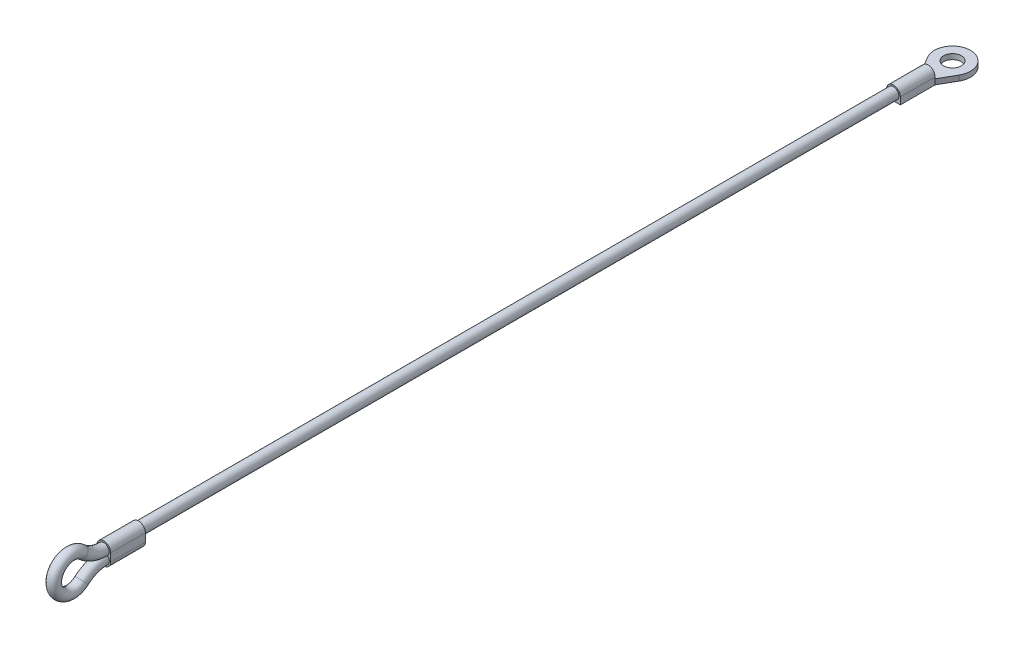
ISO-10303-21;
HEADER;
FILE_DESCRIPTION(('STEP AP214'),'2;1');
FILE_NAME('part.step','',(''),(''),'','','');
FILE_SCHEMA(('AUTOMOTIVE_DESIGN { 1 0 10303 214 1 1 1 1 }'));
ENDSEC;
DATA;
#1=APPLICATION_CONTEXT('core data for automotive mechanical design processes');
#2=APPLICATION_PROTOCOL_DEFINITION('international standard','automotive_design',2000,#1);
#3=PRODUCT_CONTEXT('',#1,'mechanical');
#4=PRODUCT('Part','Part','',(#3));
#5=PRODUCT_RELATED_PRODUCT_CATEGORY('part','',(#4));
#6=PRODUCT_DEFINITION_FORMATION('','',#4);
#7=PRODUCT_DEFINITION_CONTEXT('part definition',#1,'design');
#8=PRODUCT_DEFINITION('design','',#6,#7);
#9=PRODUCT_DEFINITION_SHAPE('','',#8);
#10=(LENGTH_UNIT() NAMED_UNIT(*) SI_UNIT(.MILLI.,.METRE.));
#11=(NAMED_UNIT(*) PLANE_ANGLE_UNIT() SI_UNIT($,.RADIAN.));
#12=(NAMED_UNIT(*) SI_UNIT($,.STERADIAN.) SOLID_ANGLE_UNIT());
#13=UNCERTAINTY_MEASURE_WITH_UNIT(LENGTH_MEASURE(1.E-05),#10,'distance_accuracy_value','');
#14=(GEOMETRIC_REPRESENTATION_CONTEXT(3) GLOBAL_UNCERTAINTY_ASSIGNED_CONTEXT((#13)) GLOBAL_UNIT_ASSIGNED_CONTEXT((#10,
#11,#12)) REPRESENTATION_CONTEXT('',''));
#15=CARTESIAN_POINT('',(0.,0.,0.));
#16=DIRECTION('',(0.,0.,1.));
#17=DIRECTION('',(1.,0.,0.));
#18=AXIS2_PLACEMENT_3D('',#15,#16,#17);
#19=CARTESIAN_POINT('',(0.,0.,-10.));
#20=DIRECTION('',(0.,0.,-1.));
#21=DIRECTION('',(-1.,0.,0.));
#22=AXIS2_PLACEMENT_3D('',#19,#20,#21);
#23=PLANE('',#22);
#24=DIRECTION('',(0.,-1.,0.));
#25=VECTOR('',#24,1.);
#26=CARTESIAN_POINT('',(1.99,0.,-10.));
#27=LINE('',#26,#25);
#28=CARTESIAN_POINT('',(1.99,0.,-10.));
#29=VERTEX_POINT('',#28);
#30=CARTESIAN_POINT('',(1.99,-0.47,-10.));
#31=VERTEX_POINT('',#30);
#32=EDGE_CURVE('E183',#29,#31,#27,.T.);
#33=ORIENTED_EDGE('',*,*,#32,.T.);
#34=DIRECTION('',(-1.,0.,0.));
#35=VECTOR('',#34,1.);
#36=CARTESIAN_POINT('',(-1.99,-0.47,-10.));
#37=LINE('',#36,#35);
#38=CARTESIAN_POINT('',(-1.99,-0.47,-10.));
#39=VERTEX_POINT('',#38);
#40=EDGE_CURVE('E141',#31,#39,#37,.T.);
#41=ORIENTED_EDGE('',*,*,#40,.T.);
#42=DIRECTION('',(0.,1.,0.));
#43=VECTOR('',#42,1.);
#44=CARTESIAN_POINT('',(-1.99,-1.99,-10.));
#45=LINE('',#44,#43);
#46=CARTESIAN_POINT('',(-1.99,0.,-10.));
#47=VERTEX_POINT('',#46);
#48=EDGE_CURVE('E187',#39,#47,#45,.T.);
#49=ORIENTED_EDGE('',*,*,#48,.T.);
#50=CARTESIAN_POINT('',(0.,0.,-10.));
#51=DIRECTION('',(0.,0.,-1.));
#52=DIRECTION('',(-1.,0.,0.));
#53=AXIS2_PLACEMENT_3D('',#50,#51,#52);
#54=CIRCLE('',#53,1.99);
#55=EDGE_CURVE('E179',#47,#29,#54,.T.);
#56=ORIENTED_EDGE('',*,*,#55,.T.);
#57=EDGE_LOOP('',(#33,#41,#49,#56));
#58=FACE_BOUND('',#57,.T.);
#59=ADVANCED_FACE('F39',(#58),#23,.T.);
#60=CARTESIAN_POINT('',(0.,0.,227.4));
#61=DIRECTION('',(0.,0.,-1.));
#62=DIRECTION('',(-1.,0.,0.));
#63=AXIS2_PLACEMENT_3D('',#60,#61,#62);
#64=CYLINDRICAL_SURFACE('',#63,1.59);
#65=CARTESIAN_POINT('',(0.,0.,217.4));
#66=DIRECTION('',(0.,0.,-1.));
#67=DIRECTION('',(0.,1.,0.));
#68=AXIS2_PLACEMENT_3D('',#65,#66,#67);
#69=CIRCLE('',#68,1.59);
#70=CARTESIAN_POINT('',(0.,1.59,217.4));
#71=VERTEX_POINT('',#70);
#72=EDGE_CURVE('E43',#71,#71,#69,.T.);
#73=ORIENTED_EDGE('',*,*,#72,.T.);
#74=EDGE_LOOP('',(#73));
#75=FACE_BOUND('',#74,.T.);
#76=CARTESIAN_POINT('',(0.,0.,0.));
#77=DIRECTION('',(0.,0.,1.));
#78=DIRECTION('',(1.,0.,0.));
#79=AXIS2_PLACEMENT_3D('',#76,#77,#78);
#80=CIRCLE('',#79,1.59);
#81=CARTESIAN_POINT('',(1.59,0.,0.));
#82=VERTEX_POINT('',#81);
#83=EDGE_CURVE('E218',#82,#82,#80,.T.);
#84=ORIENTED_EDGE('',*,*,#83,.T.);
#85=EDGE_LOOP('',(#84));
#86=FACE_BOUND('',#85,.T.);
#87=ADVANCED_FACE('F41',(#75,#86),#64,.T.);
#88=CARTESIAN_POINT('',(0.,3.14274069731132E-13,217.4));
#89=DIRECTION('',(0.,0.,1.));
#90=DIRECTION('',(0.,-1.,0.));
#91=AXIS2_PLACEMENT_3D('',#88,#89,#90);
#92=CYLINDRICAL_SURFACE('',#91,1.99);
#93=CARTESIAN_POINT('',(0.,3.28730098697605E-13,227.4));
#94=DIRECTION('',(0.,0.,-1.));
#95=DIRECTION('',(0.,1.,0.));
#96=AXIS2_PLACEMENT_3D('',#93,#94,#95);
#97=CIRCLE('',#96,1.99);
#98=CARTESIAN_POINT('',(-1.99,3.28973803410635E-13,227.4));
#99=VERTEX_POINT('',#98);
#100=CARTESIAN_POINT('',(1.99,3.28486393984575E-13,227.4));
#101=VERTEX_POINT('',#100);
#102=EDGE_CURVE('E234',#99,#101,#97,.T.);
#103=ORIENTED_EDGE('',*,*,#102,.T.);
#104=DIRECTION('',(0.,0.,1.));
#105=VECTOR('',#104,1.);
#106=CARTESIAN_POINT('',(1.99,3.14030365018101E-13,217.4));
#107=LINE('',#106,#105);
#108=CARTESIAN_POINT('',(1.99,3.14030365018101E-13,217.4));
#109=VERTEX_POINT('',#108);
#110=EDGE_CURVE('E257',#109,#101,#107,.T.);
#111=ORIENTED_EDGE('',*,*,#110,.F.);
#112=CARTESIAN_POINT('',(0.,3.14274069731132E-13,217.4));
#113=DIRECTION('',(0.,0.,-1.));
#114=DIRECTION('',(0.,1.,0.));
#115=AXIS2_PLACEMENT_3D('',#112,#113,#114);
#116=CIRCLE('',#115,1.99);
#117=CARTESIAN_POINT('',(-1.99,3.14517774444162E-13,217.4));
#118=VERTEX_POINT('',#117);
#119=EDGE_CURVE('E219',#118,#109,#116,.T.);
#120=ORIENTED_EDGE('',*,*,#119,.F.);
#121=DIRECTION('',(0.,0.,1.));
#122=VECTOR('',#121,1.);
#123=CARTESIAN_POINT('',(-1.99,3.14517774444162E-13,217.4));
#124=LINE('',#123,#122);
#125=EDGE_CURVE('E233',#118,#99,#124,.T.);
#126=ORIENTED_EDGE('',*,*,#125,.T.);
#127=EDGE_LOOP('',(#103,#111,#120,#126));
#128=FACE_BOUND('',#127,.T.);
#129=ADVANCED_FACE('F289',(#128),#92,.T.);
#130=CARTESIAN_POINT('',(1.99,3.14030365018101E-13,217.4));
#131=DIRECTION('',(-1.,0.,0.));
#132=DIRECTION('',(0.,-1.,0.));
#133=AXIS2_PLACEMENT_3D('',#130,#131,#132);
#134=PLANE('',#133);
#135=DIRECTION('',(0.,-1.,0.));
#136=VECTOR('',#135,1.);
#137=CARTESIAN_POINT('',(1.99,3.28486393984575E-13,227.4));
#138=LINE('',#137,#136);
#139=CARTESIAN_POINT('',(1.99,-2.26625258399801,227.4));
#140=VERTEX_POINT('',#139);
#141=EDGE_CURVE('E238',#101,#140,#138,.T.);
#142=ORIENTED_EDGE('',*,*,#141,.T.);
#143=DIRECTION('',(0.,0.,1.));
#144=VECTOR('',#143,1.);
#145=CARTESIAN_POINT('',(1.99,-2.26625258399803,217.4));
#146=LINE('',#145,#144);
#147=CARTESIAN_POINT('',(1.99,-2.26625258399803,217.4));
#148=VERTEX_POINT('',#147);
#149=EDGE_CURVE('E253',#148,#140,#146,.T.);
#150=ORIENTED_EDGE('',*,*,#149,.F.);
#151=DIRECTION('',(0.,-1.,0.));
#152=VECTOR('',#151,1.);
#153=CARTESIAN_POINT('',(1.99,3.14030365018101E-13,217.4));
#154=LINE('',#153,#152);
#155=EDGE_CURVE('E223',#109,#148,#154,.T.);
#156=ORIENTED_EDGE('',*,*,#155,.F.);
#157=ORIENTED_EDGE('',*,*,#110,.T.);
#158=EDGE_LOOP('',(#142,#150,#156,#157));
#159=FACE_BOUND('',#158,.T.);
#160=ADVANCED_FACE('F341',(#159),#134,.F.);
#161=CARTESIAN_POINT('',(0.,-2.26625258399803,217.4));
#162=DIRECTION('',(0.,0.,1.));
#163=DIRECTION('',(0.,-1.,0.));
#164=AXIS2_PLACEMENT_3D('',#161,#162,#163);
#165=CYLINDRICAL_SURFACE('',#164,1.99);
#166=CARTESIAN_POINT('',(0.,-2.26625258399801,227.4));
#167=DIRECTION('',(0.,0.,-1.));
#168=DIRECTION('',(0.,1.,0.));
#169=AXIS2_PLACEMENT_3D('',#166,#167,#168);
#170=CIRCLE('',#169,1.99);
#171=CARTESIAN_POINT('',(-1.99,-2.26625258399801,227.4));
#172=VERTEX_POINT('',#171);
#173=EDGE_CURVE('E241',#140,#172,#170,.T.);
#174=ORIENTED_EDGE('',*,*,#173,.T.);
#175=DIRECTION('',(0.,0.,1.));
#176=VECTOR('',#175,1.);
#177=CARTESIAN_POINT('',(-1.99,-2.26625258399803,217.4));
#178=LINE('',#177,#176);
#179=CARTESIAN_POINT('',(-1.99,-2.26625258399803,217.4));
#180=VERTEX_POINT('',#179);
#181=EDGE_CURVE('E249',#180,#172,#178,.T.);
#182=ORIENTED_EDGE('',*,*,#181,.F.);
#183=CARTESIAN_POINT('',(0.,-2.26625258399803,217.4));
#184=DIRECTION('',(0.,0.,-1.));
#185=DIRECTION('',(0.,1.,0.));
#186=AXIS2_PLACEMENT_3D('',#183,#184,#185);
#187=CIRCLE('',#186,1.99);
#188=EDGE_CURVE('E227',#148,#180,#187,.T.);
#189=ORIENTED_EDGE('',*,*,#188,.F.);
#190=ORIENTED_EDGE('',*,*,#149,.T.);
#191=EDGE_LOOP('',(#174,#182,#189,#190));
#192=FACE_BOUND('',#191,.T.);
#193=ADVANCED_FACE('F338',(#192),#165,.T.);
#194=CARTESIAN_POINT('',(-1.99,3.14517774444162E-13,217.4));
#195=DIRECTION('',(1.,0.,0.));
#196=DIRECTION('',(0.,1.,0.));
#197=AXIS2_PLACEMENT_3D('',#194,#195,#196);
#198=PLANE('',#197);
#199=DIRECTION('',(0.,1.,0.));
#200=VECTOR('',#199,1.);
#201=CARTESIAN_POINT('',(-1.99,3.28973803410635E-13,227.4));
#202=LINE('',#201,#200);
#203=EDGE_CURVE('E224',#172,#99,#202,.T.);
#204=ORIENTED_EDGE('',*,*,#203,.T.);
#205=ORIENTED_EDGE('',*,*,#125,.F.);
#206=DIRECTION('',(0.,1.,0.));
#207=VECTOR('',#206,1.);
#208=CARTESIAN_POINT('',(-1.99,3.14517774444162E-13,217.4));
#209=LINE('',#208,#207);
#210=EDGE_CURVE('E230',#180,#118,#209,.T.);
#211=ORIENTED_EDGE('',*,*,#210,.F.);
#212=ORIENTED_EDGE('',*,*,#181,.T.);
#213=EDGE_LOOP('',(#204,#205,#211,#212));
#214=FACE_BOUND('',#213,.T.);
#215=ADVANCED_FACE('F333',(#214),#198,.F.);
#216=CARTESIAN_POINT('',(0.,3.14274069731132E-13,217.4));
#217=DIRECTION('',(0.,0.,-1.));
#218=DIRECTION('',(0.,1.,0.));
#219=AXIS2_PLACEMENT_3D('',#216,#217,#218);
#220=PLANE('',#219);
#221=ORIENTED_EDGE('',*,*,#72,.F.);
#222=EDGE_LOOP('',(#221));
#223=FACE_BOUND('',#222,.T.);
#224=ORIENTED_EDGE('',*,*,#119,.T.);
#225=ORIENTED_EDGE('',*,*,#155,.T.);
#226=ORIENTED_EDGE('',*,*,#188,.T.);
#227=ORIENTED_EDGE('',*,*,#210,.T.);
#228=EDGE_LOOP('',(#224,#225,#226,#227));
#229=FACE_BOUND('',#228,.T.);
#230=ADVANCED_FACE('F300',(#223,#229),#220,.T.);
#231=CARTESIAN_POINT('',(0.,3.28730098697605E-13,227.4));
#232=DIRECTION('',(0.,0.,-1.));
#233=DIRECTION('',(0.,1.,0.));
#234=AXIS2_PLACEMENT_3D('',#231,#232,#233);
#235=PLANE('',#234);
#236=CARTESIAN_POINT('',(0.,0.,227.4));
#237=DIRECTION('',(0.,0.,1.));
#238=DIRECTION('',(1.,0.,0.));
#239=AXIS2_PLACEMENT_3D('',#236,#237,#238);
#240=CIRCLE('',#239,1.59);
#241=CARTESIAN_POINT('',(1.11540342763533,-1.13312629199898,227.4));
#242=VERTEX_POINT('',#241);
#243=CARTESIAN_POINT('',(-1.1154034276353,-1.13312629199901,227.4));
#244=VERTEX_POINT('',#243);
#245=EDGE_CURVE('E49',#242,#244,#240,.T.);
#246=ORIENTED_EDGE('',*,*,#245,.F.);
#247=CARTESIAN_POINT('',(0.,-2.26625258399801,227.4));
#248=DIRECTION('',(0.,0.,-1.));
#249=DIRECTION('',(1.,0.,0.));
#250=AXIS2_PLACEMENT_3D('',#247,#248,#249);
#251=CIRCLE('',#250,1.59);
#252=EDGE_CURVE('E63',#242,#244,#251,.T.);
#253=ORIENTED_EDGE('',*,*,#252,.T.);
#254=EDGE_LOOP('',(#246,#253));
#255=FACE_BOUND('',#254,.T.);
#256=ORIENTED_EDGE('',*,*,#102,.F.);
#257=ORIENTED_EDGE('',*,*,#203,.F.);
#258=ORIENTED_EDGE('',*,*,#173,.F.);
#259=ORIENTED_EDGE('',*,*,#141,.F.);
#260=EDGE_LOOP('',(#256,#257,#258,#259));
#261=FACE_BOUND('',#260,.T.);
#262=ADVANCED_FACE('F293',(#255,#261),#235,.F.);
#263=CARTESIAN_POINT('',(0.,-1.13312629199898,237.));
#264=DIRECTION('',(-1.,0.,0.));
#265=DIRECTION('',(0.,0.,1.));
#266=AXIS2_PLACEMENT_3D('',#263,#264,#265);
#267=TOROIDAL_SURFACE('',#266,4.8,1.59);
#268=CARTESIAN_POINT('',(0.,-4.71083505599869,233.8));
#269=DIRECTION('',(0.,0.666666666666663,-0.745355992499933));
#270=DIRECTION('',(1.,0.,0.));
#271=AXIS2_PLACEMENT_3D('',#268,#269,#270);
#272=CIRCLE('',#271,1.59);
#273=CARTESIAN_POINT('',(0.,-5.89595108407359,232.74));
#274=VERTEX_POINT('',#273);
#275=EDGE_CURVE('E263',#274,#274,#272,.T.);
#276=CARTESIAN_POINT('',(0.,2.44458247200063,233.8));
#277=DIRECTION('',(0.,0.666666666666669,0.745355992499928));
#278=DIRECTION('',(1.,0.,0.));
#279=AXIS2_PLACEMENT_3D('',#276,#277,#278);
#280=CIRCLE('',#279,1.59);
#281=CARTESIAN_POINT('',(0.,3.62969850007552,232.74));
#282=VERTEX_POINT('',#281);
#283=EDGE_CURVE('E267',#282,#282,#280,.T.);
#284=CARTESIAN_POINT('',(0.,-1.13312629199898,237.));
#285=DIRECTION('',(-1.,0.,0.));
#286=DIRECTION('',(0.,0.,1.));
#287=AXIS2_PLACEMENT_3D('',#284,#285,#286);
#288=CIRCLE('',#287,6.39);
#289=EDGE_CURVE('',#274,#282,#288,.T.);
#290=ORIENTED_EDGE('',*,*,#275,.F.);
#291=ORIENTED_EDGE('',*,*,#283,.T.);
#292=ORIENTED_EDGE('',*,*,#289,.T.);
#293=ORIENTED_EDGE('',*,*,#289,.F.);
#294=EDGE_LOOP('',(#290,#292,#291,#293));
#295=FACE_BOUND('',#294,.T.);
#296=ADVANCED_FACE('F291',(#295),#267,.T.);
#297=CARTESIAN_POINT('',(0.,9.6,227.4));
#298=DIRECTION('',(1.,0.,0.));
#299=DIRECTION('',(0.,0.,-1.));
#300=AXIS2_PLACEMENT_3D('',#297,#298,#299);
#301=TOROIDAL_SURFACE('',#300,9.6,1.59);
#302=ORIENTED_EDGE('',*,*,#283,.F.);
#303=EDGE_LOOP('',(#302));
#304=FACE_BOUND('',#303,.T.);
#305=CARTESIAN_POINT('',(1.11540342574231,-1.13312629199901,227.3998));
#306=CARTESIAN_POINT('',(1.11534851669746,-1.13312629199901,227.52773673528));
#307=CARTESIAN_POINT('',(1.11308141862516,-1.13312629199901,227.655686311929));
#308=CARTESIAN_POINT('',(1.10371453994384,-1.13312629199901,227.91155828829));
#309=CARTESIAN_POINT('',(1.09660901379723,-1.13312629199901,228.03948047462));
#310=CARTESIAN_POINT('',(1.07704253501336,-1.13312629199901,228.296418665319));
#311=CARTESIAN_POINT('',(1.06452051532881,-1.13312629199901,228.425430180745));
#312=CARTESIAN_POINT('',(1.03319430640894,-1.133126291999,228.682627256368));
#313=CARTESIAN_POINT('',(1.01439338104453,-1.133126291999,228.810813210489));
#314=CARTESIAN_POINT('',(0.966908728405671,-1.133126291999,229.078005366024));
#315=CARTESIAN_POINT('',(0.937456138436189,-1.133126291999,229.216883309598));
#316=CARTESIAN_POINT('',(0.883915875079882,-1.133126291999,229.42263125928));
#317=CARTESIAN_POINT('',(0.864530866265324,-1.133126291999,229.490724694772));
#318=CARTESIAN_POINT('',(0.82199602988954,-1.133126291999,229.625715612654));
#319=CARTESIAN_POINT('',(0.798847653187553,-1.133126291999,229.692613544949));
#320=CARTESIAN_POINT('',(0.744519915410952,-1.133126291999,229.833542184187));
#321=CARTESIAN_POINT('',(0.712679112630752,-1.133126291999,229.907321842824));
#322=CARTESIAN_POINT('',(0.641279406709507,-1.133126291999,230.051146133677));
#323=CARTESIAN_POINT('',(0.601727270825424,-1.133126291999,230.121193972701));
#324=CARTESIAN_POINT('',(0.5289483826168,-1.133126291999,230.22943568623));
#325=CARTESIAN_POINT('',(0.498892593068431,-1.133126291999,230.269741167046));
#326=CARTESIAN_POINT('',(0.433770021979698,-1.133126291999,230.3461405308));
#327=CARTESIAN_POINT('',(0.398710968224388,-1.133126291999,230.382240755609));
#328=CARTESIAN_POINT('',(0.33506020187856,-1.133126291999,230.437058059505));
#329=CARTESIAN_POINT('',(0.308066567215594,-1.133126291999,230.457612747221));
#330=CARTESIAN_POINT('',(0.251279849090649,-1.133126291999,230.494433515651));
#331=CARTESIAN_POINT('',(0.221491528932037,-1.133126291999,230.510706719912));
#332=CARTESIAN_POINT('',(0.165682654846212,-1.133126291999,230.534797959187));
#333=CARTESIAN_POINT('',(0.140117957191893,-1.133126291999,230.543660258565));
#334=CARTESIAN_POINT('',(0.0878641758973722,-1.133126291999,230.556990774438));
#335=CARTESIAN_POINT('',(0.0611762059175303,-1.133126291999,230.561463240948));
#336=CARTESIAN_POINT('',(0.0073177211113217,-1.133126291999,230.565572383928));
#337=CARTESIAN_POINT('',(-0.0198542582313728,-1.133126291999,230.565190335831));
#338=CARTESIAN_POINT('',(-0.0736951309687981,-1.133126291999,230.559586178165));
#339=CARTESIAN_POINT('',(-0.100363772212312,-1.133126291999,230.554361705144));
#340=CARTESIAN_POINT('',(-0.151195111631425,-1.133126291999,230.539957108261));
#341=CARTESIAN_POINT('',(-0.175416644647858,-1.133126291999,230.530979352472));
#342=CARTESIAN_POINT('',(-0.222373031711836,-1.133126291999,230.509774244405));
#343=CARTESIAN_POINT('',(-0.24510733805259,-1.133126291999,230.497545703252));
#344=CARTESIAN_POINT('',(-0.304759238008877,-1.133126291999,230.460748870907));
#345=CARTESIAN_POINT('',(-0.340101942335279,-1.133126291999,230.433635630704));
#346=CARTESIAN_POINT('',(-0.406281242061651,-1.133126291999,230.37436880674));
#347=CARTESIAN_POINT('',(-0.437102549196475,-1.133126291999,230.342198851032));
#348=CARTESIAN_POINT('',(-0.492718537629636,-1.133126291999,230.27701365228));
#349=CARTESIAN_POINT('',(-0.517788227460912,-1.133126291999,230.244229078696));
#350=CARTESIAN_POINT('',(-0.565060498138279,-1.133126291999,230.176639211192));
#351=CARTESIAN_POINT('',(-0.587260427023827,-1.133126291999,230.141832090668));
#352=CARTESIAN_POINT('',(-0.650275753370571,-1.133126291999,230.035150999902));
#353=CARTESIAN_POINT('',(-0.68742850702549,-1.133126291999,229.961116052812));
#354=CARTESIAN_POINT('',(-0.745434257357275,-1.133126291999,229.830275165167));
#355=CARTESIAN_POINT('',(-0.767985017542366,-1.133126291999,229.774182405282));
#356=CARTESIAN_POINT('',(-0.809859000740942,-1.133126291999,229.660796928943));
#357=CARTESIAN_POINT('',(-0.829181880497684,-1.133126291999,229.603504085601));
#358=CARTESIAN_POINT('',(-0.883166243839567,-1.133126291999,229.430173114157));
#359=CARTESIAN_POINT('',(-0.913763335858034,-1.133126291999,229.312874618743));
#360=CARTESIAN_POINT('',(-0.967023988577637,-1.133126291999,229.075955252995));
#361=CARTESIAN_POINT('',(-0.989647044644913,-1.133126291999,228.956325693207));
#362=CARTESIAN_POINT('',(-1.02845868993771,-1.133126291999,228.716012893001));
#363=CARTESIAN_POINT('',(-1.0446457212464,-1.13312629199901,228.595329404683));
#364=CARTESIAN_POINT('',(-1.06818793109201,-1.13312629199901,228.38453669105));
#365=CARTESIAN_POINT('',(-1.07674400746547,-1.13312629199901,228.294556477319));
#366=CARTESIAN_POINT('',(-1.09119671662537,-1.13312629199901,228.114367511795));
#367=CARTESIAN_POINT('',(-1.09709289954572,-1.13312629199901,228.024158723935));
#368=CARTESIAN_POINT('',(-1.10635885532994,-1.13312629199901,227.844939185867));
#369=CARTESIAN_POINT('',(-1.10976438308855,-1.13312629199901,227.755930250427));
#370=CARTESIAN_POINT('',(-1.11428069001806,-1.13312629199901,227.577880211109));
#371=CARTESIAN_POINT('',(-1.1153921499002,-1.13312629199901,227.488839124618));
#372=CARTESIAN_POINT('',(-1.11540342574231,-1.13312629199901,227.3998));
#373=B_SPLINE_CURVE_WITH_KNOTS('',3,(#305,#306,#307,#308,#309,#310,#311,#312,#313,#314,#315,
#316,#317,#318,#319,#320,#321,#322,#323,#324,#325,#326,#327,#328,#329,#330,#331,#332,#333,#334,
#335,#336,#337,#338,#339,#340,#341,#342,#343,#344,#345,#346,#347,#348,#349,#350,#351,#352,#353,
#354,#355,#356,#357,#358,#359,#360,#361,#362,#363,#364,#365,#366,#367,#368,#369,#370,#371,#372),
.UNSPECIFIED.,.F.,.F.,(4,2,2,2,2,2,2,2,2,2,2,2,2,2,2,2,2,2,2,2,2,2,2,2,2,2,2,2,2,2,2,2,2,4),(0.,
0.383810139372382,0.768076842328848,1.1567936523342,1.54530871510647,1.97071269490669,
2.18302701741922,2.39525968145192,2.63604166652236,2.87661329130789,3.02716706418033,
3.177490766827,3.27898827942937,3.38031583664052,3.46115731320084,3.54192044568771,
3.62299518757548,3.70410952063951,3.78132200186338,3.85856276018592,3.99142265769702,
4.12472192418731,4.24834991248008,4.3720913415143,4.61994843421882,4.80123584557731,
4.982542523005,5.34577733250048,5.71083149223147,6.07597396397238,6.34709439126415,
6.61826065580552,6.88545336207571,7.15256677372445),.UNSPECIFIED.);
#374=EDGE_CURVE('E11',#242,#244,#373,.T.);
#375=ORIENTED_EDGE('',*,*,#374,.F.);
#376=ORIENTED_EDGE('',*,*,#245,.T.);
#377=EDGE_LOOP('',(#375,#376));
#378=FACE_BOUND('',#377,.T.);
#379=ADVANCED_FACE('F280',(#304,#378),#301,.T.);
#380=CARTESIAN_POINT('',(0.,-11.866252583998,227.4));
#381=DIRECTION('',(1.,0.,0.));
#382=DIRECTION('',(0.,0.,-1.));
#383=AXIS2_PLACEMENT_3D('',#380,#381,#382);
#384=TOROIDAL_SURFACE('',#383,9.6,1.59);
#385=ORIENTED_EDGE('',*,*,#275,.T.);
#386=EDGE_LOOP('',(#385));
#387=FACE_BOUND('',#386,.T.);
#388=ORIENTED_EDGE('',*,*,#252,.F.);
#389=ORIENTED_EDGE('',*,*,#374,.T.);
#390=EDGE_LOOP('',(#388,#389));
#391=FACE_BOUND('',#390,.T.);
#392=ADVANCED_FACE('F283',(#387,#391),#384,.T.);
#393=CARTESIAN_POINT('',(0.,0.,-10.));
#394=DIRECTION('',(0.,0.,1.));
#395=DIRECTION('',(1.,0.,0.));
#396=AXIS2_PLACEMENT_3D('',#393,#394,#395);
#397=CYLINDRICAL_SURFACE('',#396,1.99);
#398=CARTESIAN_POINT('',(0.,0.,0.));
#399=DIRECTION('',(0.,0.,-1.));
#400=DIRECTION('',(-1.,0.,0.));
#401=AXIS2_PLACEMENT_3D('',#398,#399,#400);
#402=CIRCLE('',#401,1.99);
#403=CARTESIAN_POINT('',(-1.99,0.,0.));
#404=VERTEX_POINT('',#403);
#405=CARTESIAN_POINT('',(1.99,0.,0.));
#406=VERTEX_POINT('',#405);
#407=EDGE_CURVE('E176',#404,#406,#402,.T.);
#408=ORIENTED_EDGE('',*,*,#407,.T.);
#409=DIRECTION('',(0.,0.,1.));
#410=VECTOR('',#409,1.);
#411=CARTESIAN_POINT('',(1.99,0.,-10.));
#412=LINE('',#411,#410);
#413=EDGE_CURVE('E214',#29,#406,#412,.T.);
#414=ORIENTED_EDGE('',*,*,#413,.F.);
#415=ORIENTED_EDGE('',*,*,#55,.F.);
#416=DIRECTION('',(0.,0.,1.));
#417=VECTOR('',#416,1.);
#418=CARTESIAN_POINT('',(-1.99,0.,-10.));
#419=LINE('',#418,#417);
#420=EDGE_CURVE('E190',#47,#404,#419,.T.);
#421=ORIENTED_EDGE('',*,*,#420,.T.);
#422=EDGE_LOOP('',(#408,#414,#415,#421));
#423=FACE_BOUND('',#422,.T.);
#424=ADVANCED_FACE('F287',(#423),#397,.T.);
#425=CARTESIAN_POINT('',(1.99,0.,-10.));
#426=DIRECTION('',(-1.,0.,0.));
#427=DIRECTION('',(0.,-1.,0.));
#428=AXIS2_PLACEMENT_3D('',#425,#426,#427);
#429=PLANE('',#428);
#430=DIRECTION('',(0.,-1.,0.));
#431=VECTOR('',#430,1.);
#432=CARTESIAN_POINT('',(1.99,0.,0.));
#433=LINE('',#432,#431);
#434=CARTESIAN_POINT('',(1.99,-1.99,0.));
#435=VERTEX_POINT('',#434);
#436=EDGE_CURVE('E194',#406,#435,#433,.T.);
#437=ORIENTED_EDGE('',*,*,#436,.T.);
#438=DIRECTION('',(0.,0.,1.));
#439=VECTOR('',#438,1.);
#440=CARTESIAN_POINT('',(1.99,-1.99,-10.));
#441=LINE('',#440,#439);
#442=CARTESIAN_POINT('',(1.99,-1.99,-10.));
#443=VERTEX_POINT('',#442);
#444=EDGE_CURVE('E210',#443,#435,#441,.T.);
#445=ORIENTED_EDGE('',*,*,#444,.F.);
#446=DIRECTION('',(0.,-1.,0.));
#447=VECTOR('',#446,1.);
#448=CARTESIAN_POINT('',(1.99,-0.47,-10.));
#449=LINE('',#448,#447);
#450=EDGE_CURVE('E173',#31,#443,#449,.T.);
#451=ORIENTED_EDGE('',*,*,#450,.F.);
#452=ORIENTED_EDGE('',*,*,#32,.F.);
#453=ORIENTED_EDGE('',*,*,#413,.T.);
#454=EDGE_LOOP('',(#437,#445,#451,#452,#453));
#455=FACE_BOUND('',#454,.T.);
#456=ADVANCED_FACE('F324',(#455),#429,.F.);
#457=CARTESIAN_POINT('',(0.,-1.99,-10.));
#458=DIRECTION('',(0.,1.,0.));
#459=DIRECTION('',(0.,0.,1.));
#460=AXIS2_PLACEMENT_3D('',#457,#458,#459);
#461=PLANE('',#460);
#462=DIRECTION('',(-1.,0.,0.));
#463=VECTOR('',#462,1.);
#464=CARTESIAN_POINT('',(0.,-1.99,0.));
#465=LINE('',#464,#463);
#466=CARTESIAN_POINT('',(-1.99,-1.99,0.));
#467=VERTEX_POINT('',#466);
#468=EDGE_CURVE('E198',#435,#467,#465,.T.);
#469=ORIENTED_EDGE('',*,*,#468,.T.);
#470=DIRECTION('',(0.,0.,1.));
#471=VECTOR('',#470,1.);
#472=CARTESIAN_POINT('',(-1.99,-1.99,-10.));
#473=LINE('',#472,#471);
#474=CARTESIAN_POINT('',(-1.99,-1.99,-10.));
#475=VERTEX_POINT('',#474);
#476=EDGE_CURVE('E206',#475,#467,#473,.T.);
#477=ORIENTED_EDGE('',*,*,#476,.F.);
#478=DIRECTION('',(-0.496859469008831,0.,-0.867831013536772));
#479=VECTOR('',#478,1.);
#480=CARTESIAN_POINT('',(-4.5170604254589,-1.99,-14.413846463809));
#481=LINE('',#480,#479);
#482=CARTESIAN_POINT('',(-4.5170604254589,-1.99,-14.413846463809));
#483=VERTEX_POINT('',#482);
#484=EDGE_CURVE('E168',#475,#483,#481,.T.);
#485=ORIENTED_EDGE('',*,*,#484,.T.);
#486=CARTESIAN_POINT('',(0.,-1.99,-17.));
#487=DIRECTION('',(0.,-1.,0.));
#488=DIRECTION('',(0.,0.,1.));
#489=AXIS2_PLACEMENT_3D('',#486,#487,#488);
#490=CIRCLE('',#489,5.205);
#491=CARTESIAN_POINT('',(4.5170604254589,-1.99,-14.413846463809));
#492=VERTEX_POINT('',#491);
#493=EDGE_CURVE('E136',#483,#492,#490,.T.);
#494=ORIENTED_EDGE('',*,*,#493,.T.);
#495=DIRECTION('',(-0.496859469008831,0.,0.867831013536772));
#496=VECTOR('',#495,1.);
#497=CARTESIAN_POINT('',(1.99,-1.99,-10.));
#498=LINE('',#497,#496);
#499=EDGE_CURVE('E153',#492,#443,#498,.T.);
#500=ORIENTED_EDGE('',*,*,#499,.T.);
#501=ORIENTED_EDGE('',*,*,#444,.T.);
#502=EDGE_LOOP('',(#469,#477,#485,#494,#500,#501));
#503=FACE_BOUND('',#502,.T.);
#504=CARTESIAN_POINT('',(0.,-1.99,-17.));
#505=DIRECTION('',(0.,-1.,0.));
#506=DIRECTION('',(0.,0.,-1.));
#507=AXIS2_PLACEMENT_3D('',#504,#505,#506);
#508=CIRCLE('',#507,2.54);
#509=CARTESIAN_POINT('',(0.,-1.99,-19.54));
#510=VERTEX_POINT('',#509);
#511=EDGE_CURVE('E161',#510,#510,#508,.T.);
#512=ORIENTED_EDGE('',*,*,#511,.F.);
#513=EDGE_LOOP('',(#512));
#514=FACE_BOUND('',#513,.T.);
#515=ADVANCED_FACE('F320',(#503,#514),#461,.F.);
#516=CARTESIAN_POINT('',(-1.99,-1.99,-10.));
#517=DIRECTION('',(1.,0.,0.));
#518=DIRECTION('',(0.,1.,0.));
#519=AXIS2_PLACEMENT_3D('',#516,#517,#518);
#520=PLANE('',#519);
#521=DIRECTION('',(0.,1.,0.));
#522=VECTOR('',#521,1.);
#523=CARTESIAN_POINT('',(-1.99,-1.99,0.));
#524=LINE('',#523,#522);
#525=EDGE_CURVE('E184',#467,#404,#524,.T.);
#526=ORIENTED_EDGE('',*,*,#525,.T.);
#527=ORIENTED_EDGE('',*,*,#420,.F.);
#528=ORIENTED_EDGE('',*,*,#48,.F.);
#529=EDGE_CURVE('E150',#475,#39,#45,.T.);
#530=ORIENTED_EDGE('',*,*,#529,.F.);
#531=ORIENTED_EDGE('',*,*,#476,.T.);
#532=EDGE_LOOP('',(#526,#527,#528,#530,#531));
#533=FACE_BOUND('',#532,.T.);
#534=ADVANCED_FACE('F316',(#533),#520,.F.);
#535=CARTESIAN_POINT('',(0.,0.,0.));
#536=DIRECTION('',(0.,0.,-1.));
#537=DIRECTION('',(-1.,0.,0.));
#538=AXIS2_PLACEMENT_3D('',#535,#536,#537);
#539=PLANE('',#538);
#540=ORIENTED_EDGE('',*,*,#83,.F.);
#541=EDGE_LOOP('',(#540));
#542=FACE_BOUND('',#541,.T.);
#543=ORIENTED_EDGE('',*,*,#407,.F.);
#544=ORIENTED_EDGE('',*,*,#525,.F.);
#545=ORIENTED_EDGE('',*,*,#468,.F.);
#546=ORIENTED_EDGE('',*,*,#436,.F.);
#547=EDGE_LOOP('',(#543,#544,#545,#546));
#548=FACE_BOUND('',#547,.T.);
#549=ADVANCED_FACE('F313',(#542,#548),#539,.F.);
#550=CARTESIAN_POINT('',(-4.5170604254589,-0.47,-14.413846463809));
#551=DIRECTION('',(-0.867831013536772,0.,0.496859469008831));
#552=DIRECTION('',(0.496859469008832,0.,0.867831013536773));
#553=AXIS2_PLACEMENT_3D('',#550,#551,#552);
#554=PLANE('',#553);
#555=ORIENTED_EDGE('',*,*,#484,.F.);
#556=ORIENTED_EDGE('',*,*,#529,.T.);
#557=DIRECTION('',(-0.496859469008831,0.,-0.867831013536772));
#558=VECTOR('',#557,1.);
#559=CARTESIAN_POINT('',(-4.5170604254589,-0.47,-14.413846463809));
#560=LINE('',#559,#558);
#561=CARTESIAN_POINT('',(-4.5170604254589,-0.47,-14.413846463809));
#562=VERTEX_POINT('',#561);
#563=EDGE_CURVE('E56',#39,#562,#560,.T.);
#564=ORIENTED_EDGE('',*,*,#563,.T.);
#565=DIRECTION('',(0.,-1.,0.));
#566=VECTOR('',#565,1.);
#567=CARTESIAN_POINT('',(-4.5170604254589,-0.47,-14.413846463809));
#568=LINE('',#567,#566);
#569=EDGE_CURVE('E132',#562,#483,#568,.T.);
#570=ORIENTED_EDGE('',*,*,#569,.T.);
#571=EDGE_LOOP('',(#555,#556,#564,#570));
#572=FACE_BOUND('',#571,.T.);
#573=ADVANCED_FACE('F148',(#572),#554,.T.);
#574=CARTESIAN_POINT('',(1.99,-0.47,-10.));
#575=DIRECTION('',(0.867831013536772,0.,0.496859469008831));
#576=DIRECTION('',(0.496859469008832,0.,-0.867831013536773));
#577=AXIS2_PLACEMENT_3D('',#574,#575,#576);
#578=PLANE('',#577);
#579=ORIENTED_EDGE('',*,*,#499,.F.);
#580=DIRECTION('',(0.,-1.,0.));
#581=VECTOR('',#580,1.);
#582=CARTESIAN_POINT('',(4.5170604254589,-0.47,-14.413846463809));
#583=LINE('',#582,#581);
#584=CARTESIAN_POINT('',(4.5170604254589,-0.47,-14.413846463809));
#585=VERTEX_POINT('',#584);
#586=EDGE_CURVE('E140',#585,#492,#583,.T.);
#587=ORIENTED_EDGE('',*,*,#586,.F.);
#588=DIRECTION('',(-0.496859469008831,0.,0.867831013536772));
#589=VECTOR('',#588,1.);
#590=CARTESIAN_POINT('',(1.99,-0.47,-10.));
#591=LINE('',#590,#589);
#592=EDGE_CURVE('E145',#585,#31,#591,.T.);
#593=ORIENTED_EDGE('',*,*,#592,.T.);
#594=ORIENTED_EDGE('',*,*,#450,.T.);
#595=EDGE_LOOP('',(#579,#587,#593,#594));
#596=FACE_BOUND('',#595,.T.);
#597=ADVANCED_FACE('F408',(#596),#578,.T.);
#598=CARTESIAN_POINT('',(0.,-0.47,-17.));
#599=DIRECTION('',(0.,-1.,0.));
#600=DIRECTION('',(0.,0.,-1.));
#601=AXIS2_PLACEMENT_3D('',#598,#599,#600);
#602=CYLINDRICAL_SURFACE('',#601,5.205);
#603=ORIENTED_EDGE('',*,*,#493,.F.);
#604=ORIENTED_EDGE('',*,*,#569,.F.);
#605=CARTESIAN_POINT('',(0.,-0.47,-17.));
#606=DIRECTION('',(0.,-1.,0.));
#607=DIRECTION('',(0.,0.,1.));
#608=AXIS2_PLACEMENT_3D('',#605,#606,#607);
#609=CIRCLE('',#608,5.205);
#610=EDGE_CURVE('E134',#562,#585,#609,.T.);
#611=ORIENTED_EDGE('',*,*,#610,.T.);
#612=ORIENTED_EDGE('',*,*,#586,.T.);
#613=EDGE_LOOP('',(#603,#604,#611,#612));
#614=FACE_BOUND('',#613,.T.);
#615=ADVANCED_FACE('F133',(#614),#602,.T.);
#616=CARTESIAN_POINT('',(0.,-0.47,-17.));
#617=DIRECTION('',(0.,1.,0.));
#618=DIRECTION('',(0.,0.,1.));
#619=AXIS2_PLACEMENT_3D('',#616,#617,#618);
#620=PLANE('',#619);
#621=CARTESIAN_POINT('',(0.,-0.47,-17.));
#622=DIRECTION('',(0.,-1.,0.));
#623=DIRECTION('',(0.,0.,-1.));
#624=AXIS2_PLACEMENT_3D('',#621,#622,#623);
#625=CIRCLE('',#624,2.54);
#626=CARTESIAN_POINT('',(0.,-0.47,-19.54));
#627=VERTEX_POINT('',#626);
#628=EDGE_CURVE('E170',#627,#627,#625,.T.);
#629=ORIENTED_EDGE('',*,*,#628,.T.);
#630=EDGE_LOOP('',(#629));
#631=FACE_BOUND('',#630,.T.);
#632=ORIENTED_EDGE('',*,*,#563,.F.);
#633=ORIENTED_EDGE('',*,*,#40,.F.);
#634=ORIENTED_EDGE('',*,*,#592,.F.);
#635=ORIENTED_EDGE('',*,*,#610,.F.);
#636=EDGE_LOOP('',(#632,#633,#634,#635));
#637=FACE_BOUND('',#636,.T.);
#638=ADVANCED_FACE('F144',(#631,#637),#620,.T.);
#639=CARTESIAN_POINT('',(0.,-0.47,-17.));
#640=DIRECTION('',(0.,-1.,0.));
#641=DIRECTION('',(0.,0.,-1.));
#642=AXIS2_PLACEMENT_3D('',#639,#640,#641);
#643=CYLINDRICAL_SURFACE('',#642,2.54);
#644=ORIENTED_EDGE('',*,*,#628,.F.);
#645=EDGE_LOOP('',(#644));
#646=FACE_BOUND('',#645,.T.);
#647=ORIENTED_EDGE('',*,*,#511,.T.);
#648=EDGE_LOOP('',(#647));
#649=FACE_BOUND('',#648,.T.);
#650=ADVANCED_FACE('F432',(#646,#649),#643,.F.);
#651=CLOSED_SHELL('',(#59,#87,#129,#160,#193,#215,#230,#262,#296,#379,#392,#424,#456,#515,#534,
#549,#573,#597,#615,#638,#650));
#652=MANIFOLD_SOLID_BREP('B2',#651);
#653=ADVANCED_BREP_SHAPE_REPRESENTATION('',(#18,#652),#14);
#654=SHAPE_DEFINITION_REPRESENTATION(#9,#653);
ENDSEC;
END-ISO-10303-21;
